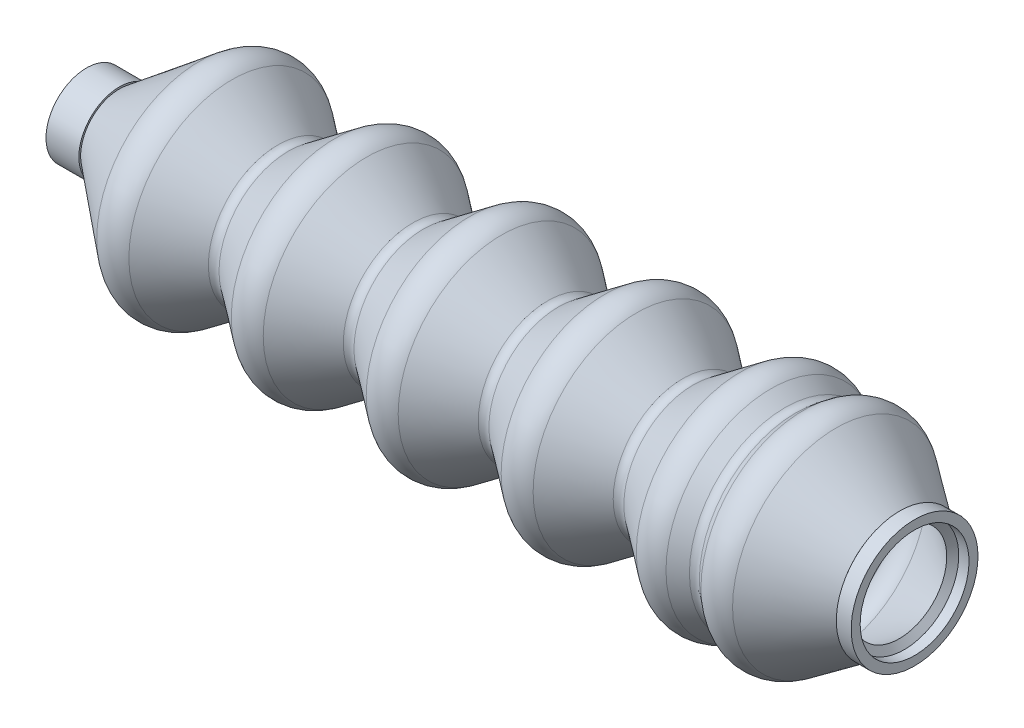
ISO-10303-21;
HEADER;
FILE_DESCRIPTION(('STEP AP214'),'2;1');
FILE_NAME('part.step','',(''),(''),'','','');
FILE_SCHEMA(('AUTOMOTIVE_DESIGN { 1 0 10303 214 1 1 1 1 }'));
ENDSEC;
DATA;
#1=APPLICATION_CONTEXT('core data for automotive mechanical design processes');
#2=APPLICATION_PROTOCOL_DEFINITION('international standard','automotive_design',2000,#1);
#3=PRODUCT_CONTEXT('',#1,'mechanical');
#4=PRODUCT('Part','Part','',(#3));
#5=PRODUCT_RELATED_PRODUCT_CATEGORY('part','',(#4));
#6=PRODUCT_DEFINITION_FORMATION('','',#4);
#7=PRODUCT_DEFINITION_CONTEXT('part definition',#1,'design');
#8=PRODUCT_DEFINITION('design','',#6,#7);
#9=PRODUCT_DEFINITION_SHAPE('','',#8);
#10=(LENGTH_UNIT() NAMED_UNIT(*) SI_UNIT(.MILLI.,.METRE.));
#11=(NAMED_UNIT(*) PLANE_ANGLE_UNIT() SI_UNIT($,.RADIAN.));
#12=(NAMED_UNIT(*) SI_UNIT($,.STERADIAN.) SOLID_ANGLE_UNIT());
#13=UNCERTAINTY_MEASURE_WITH_UNIT(LENGTH_MEASURE(1.E-05),#10,'distance_accuracy_value','');
#14=(GEOMETRIC_REPRESENTATION_CONTEXT(3) GLOBAL_UNCERTAINTY_ASSIGNED_CONTEXT((#13)) GLOBAL_UNIT_ASSIGNED_CONTEXT((#10,
#11,#12)) REPRESENTATION_CONTEXT('',''));
#15=CARTESIAN_POINT('',(0.,0.,0.));
#16=DIRECTION('',(0.,0.,1.));
#17=DIRECTION('',(1.,0.,0.));
#18=AXIS2_PLACEMENT_3D('',#15,#16,#17);
#19=CARTESIAN_POINT('',(327.155555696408,36.6460458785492,0.));
#20=DIRECTION('',(1.,0.,0.));
#21=DIRECTION('',(0.,0.,-1.));
#22=AXIS2_PLACEMENT_3D('',#19,#20,#21);
#23=PLANE('',#22);
#24=CARTESIAN_POINT('',(327.155555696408,42.6955868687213,0.));
#25=DIRECTION('',(1.,0.,0.));
#26=DIRECTION('',(0.,0.,-1.));
#27=AXIS2_PLACEMENT_3D('',#24,#25,#26);
#28=CIRCLE('',#27,7.04954099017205);
#29=CARTESIAN_POINT('',(327.155555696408,42.6955868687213,-7.04954099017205));
#30=VERTEX_POINT('',#29);
#31=EDGE_CURVE('E34',#30,#30,#28,.F.);
#32=ORIENTED_EDGE('',*,*,#31,.F.);
#33=EDGE_LOOP('',(#32));
#34=FACE_BOUND('',#33,.T.);
#35=CARTESIAN_POINT('',(327.155555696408,42.6955868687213,0.));
#36=DIRECTION('',(-1.,0.,0.));
#37=DIRECTION('',(0.,0.,1.));
#38=AXIS2_PLACEMENT_3D('',#35,#36,#37);
#39=CIRCLE('',#38,6.04954099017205);
#40=CARTESIAN_POINT('',(327.155555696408,42.6955868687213,6.04954099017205));
#41=VERTEX_POINT('',#40);
#42=EDGE_CURVE('E200',#41,#41,#39,.T.);
#43=ORIENTED_EDGE('',*,*,#42,.T.);
#44=EDGE_LOOP('',(#43));
#45=FACE_BOUND('',#44,.T.);
#46=ADVANCED_FACE('F30',(#34,#45),#23,.T.);
#47=CARTESIAN_POINT('',(235.109775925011,42.6955868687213,0.));
#48=DIRECTION('',(-1.,0.,0.));
#49=DIRECTION('',(0.,0.,1.));
#50=AXIS2_PLACEMENT_3D('',#47,#48,#49);
#51=PLANE('',#50);
#52=CARTESIAN_POINT('',(235.109775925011,42.6955868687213,0.));
#53=DIRECTION('',(-1.,0.,0.));
#54=DIRECTION('',(0.,0.,1.));
#55=AXIS2_PLACEMENT_3D('',#52,#53,#54);
#56=CIRCLE('',#55,3.50236583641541);
#57=CARTESIAN_POINT('',(235.109775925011,42.6955868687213,3.50236583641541));
#58=VERTEX_POINT('',#57);
#59=EDGE_CURVE('E119',#58,#58,#56,.T.);
#60=ORIENTED_EDGE('',*,*,#59,.F.);
#61=EDGE_LOOP('',(#60));
#62=FACE_BOUND('',#61,.T.);
#63=CARTESIAN_POINT('',(235.109775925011,42.6955868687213,0.));
#64=DIRECTION('',(-1.,0.,0.));
#65=DIRECTION('',(0.,0.,1.));
#66=AXIS2_PLACEMENT_3D('',#63,#64,#65);
#67=CIRCLE('',#66,4.50236583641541);
#68=CARTESIAN_POINT('',(235.109775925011,42.6955868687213,4.50236583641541));
#69=VERTEX_POINT('',#68);
#70=EDGE_CURVE('E10',#69,#69,#67,.T.);
#71=ORIENTED_EDGE('',*,*,#70,.T.);
#72=EDGE_LOOP('',(#71));
#73=FACE_BOUND('',#72,.T.);
#74=ADVANCED_FACE('F367',(#62,#73),#51,.T.);
#75=CARTESIAN_POINT('',(235.109775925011,42.6955868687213,0.));
#76=DIRECTION('',(-1.,0.,0.));
#77=DIRECTION('',(0.,0.,1.));
#78=AXIS2_PLACEMENT_3D('',#75,#76,#77);
#79=CYLINDRICAL_SURFACE('',#78,4.50236583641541);
#80=CARTESIAN_POINT('',(238.763083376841,42.6955868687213,0.));
#81=DIRECTION('',(1.,0.,0.));
#82=DIRECTION('',(0.,0.,-1.));
#83=AXIS2_PLACEMENT_3D('',#80,#81,#82);
#84=CIRCLE('',#83,4.50236583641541);
#85=CARTESIAN_POINT('',(238.763083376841,42.6955868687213,-4.50236583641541));
#86=VERTEX_POINT('',#85);
#87=EDGE_CURVE('E38',#86,#86,#84,.F.);
#88=ORIENTED_EDGE('',*,*,#87,.T.);
#89=EDGE_LOOP('',(#88));
#90=FACE_BOUND('',#89,.T.);
#91=ORIENTED_EDGE('',*,*,#70,.F.);
#92=EDGE_LOOP('',(#91));
#93=FACE_BOUND('',#92,.T.);
#94=ADVANCED_FACE('F369',(#90,#93),#79,.T.);
#95=CARTESIAN_POINT('',(238.763083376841,39.1932210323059,0.));
#96=DIRECTION('',(1.,0.,0.));
#97=DIRECTION('',(0.,0.,-1.));
#98=AXIS2_PLACEMENT_3D('',#95,#96,#97);
#99=PLANE('',#98);
#100=CARTESIAN_POINT('',(238.763083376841,42.6955868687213,0.));
#101=DIRECTION('',(1.,0.,0.));
#102=DIRECTION('',(0.,0.,-1.));
#103=AXIS2_PLACEMENT_3D('',#100,#101,#102);
#104=CIRCLE('',#103,4.30684761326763);
#105=CARTESIAN_POINT('',(238.763083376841,42.6955868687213,-4.30684761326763));
#106=VERTEX_POINT('',#105);
#107=EDGE_CURVE('E42',#106,#106,#104,.F.);
#108=ORIENTED_EDGE('',*,*,#107,.T.);
#109=EDGE_LOOP('',(#108));
#110=FACE_BOUND('',#109,.T.);
#111=ORIENTED_EDGE('',*,*,#87,.F.);
#112=EDGE_LOOP('',(#111));
#113=FACE_BOUND('',#112,.T.);
#114=ADVANCED_FACE('F375',(#110,#113),#99,.T.);
#115=CARTESIAN_POINT('',(237.139138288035,42.6955868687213,0.));
#116=DIRECTION('',(1.,0.,0.));
#117=DIRECTION('',(0.,0.,-1.));
#118=AXIS2_PLACEMENT_3D('',#115,#116,#117);
#119=CONICAL_SURFACE('',#118,3.01024644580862,0.673780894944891);
#120=CARTESIAN_POINT('',(247.639422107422,42.6955868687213,0.));
#121=DIRECTION('',(1.,0.,0.));
#122=DIRECTION('',(0.,0.,-1.));
#123=AXIS2_PLACEMENT_3D('',#120,#121,#122);
#124=CIRCLE('',#123,11.3939537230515);
#125=CARTESIAN_POINT('',(247.639422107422,42.6955868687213,-11.3939537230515));
#126=VERTEX_POINT('',#125);
#127=EDGE_CURVE('E114',#126,#126,#124,.F.);
#128=ORIENTED_EDGE('',*,*,#127,.T.);
#129=EDGE_LOOP('',(#128));
#130=FACE_BOUND('',#129,.T.);
#131=ORIENTED_EDGE('',*,*,#107,.F.);
#132=EDGE_LOOP('',(#131));
#133=FACE_BOUND('',#132,.T.);
#134=ADVANCED_FACE('F383',(#130,#133),#119,.T.);
#135=CARTESIAN_POINT('',(249.511257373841,42.6955868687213,0.));
#136=DIRECTION('',(-1.,0.,0.));
#137=DIRECTION('',(0.,0.,1.));
#138=AXIS2_PLACEMENT_3D('',#135,#136,#137);
#139=TOROIDAL_SURFACE('',#138,9.04954916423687,3.00000000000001);
#140=CARTESIAN_POINT('',(251.287397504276,42.6955868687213,0.));
#141=DIRECTION('',(-1.,0.,0.));
#142=DIRECTION('',(0.,0.,1.));
#143=AXIS2_PLACEMENT_3D('',#140,#141,#142);
#144=CIRCLE('',#143,11.4672601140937);
#145=CARTESIAN_POINT('',(251.287397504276,42.6955868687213,11.4672601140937));
#146=VERTEX_POINT('',#145);
#147=EDGE_CURVE('E111',#146,#146,#144,.T.);
#148=ORIENTED_EDGE('',*,*,#147,.T.);
#149=EDGE_LOOP('',(#148));
#150=FACE_BOUND('',#149,.T.);
#151=ORIENTED_EDGE('',*,*,#127,.F.);
#152=EDGE_LOOP('',(#151));
#153=FACE_BOUND('',#152,.T.);
#154=ADVANCED_FACE('F387',(#150,#153),#139,.T.);
#155=CARTESIAN_POINT('',(251.287397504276,42.6955868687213,0.));
#156=DIRECTION('',(-1.,0.,0.));
#157=DIRECTION('',(0.,0.,1.));
#158=AXIS2_PLACEMENT_3D('',#155,#156,#157);
#159=CONICAL_SURFACE('',#158,11.4672601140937,0.633596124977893);
#160=CARTESIAN_POINT('',(256.380982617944,42.6955868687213,0.));
#161=DIRECTION('',(-1.,0.,0.));
#162=DIRECTION('',(0.,0.,1.));
#163=AXIS2_PLACEMENT_3D('',#160,#161,#162);
#164=CIRCLE('',#163,7.72532358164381);
#165=CARTESIAN_POINT('',(256.380982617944,42.6955868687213,7.72532358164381));
#166=VERTEX_POINT('',#165);
#167=EDGE_CURVE('E108',#166,#166,#164,.T.);
#168=ORIENTED_EDGE('',*,*,#167,.T.);
#169=EDGE_LOOP('',(#168));
#170=FACE_BOUND('',#169,.T.);
#171=ORIENTED_EDGE('',*,*,#147,.F.);
#172=EDGE_LOOP('',(#171));
#173=FACE_BOUND('',#172,.T.);
#174=ADVANCED_FACE('F391',(#170,#173),#159,.T.);
#175=CARTESIAN_POINT('',(256.973029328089,42.6955868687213,0.));
#176=DIRECTION('',(-1.,0.,0.));
#177=DIRECTION('',(0.,0.,1.));
#178=AXIS2_PLACEMENT_3D('',#175,#176,#177);
#179=TOROIDAL_SURFACE('',#178,8.53122723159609,1.00000000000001);
#180=CARTESIAN_POINT('',(257.565076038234,42.6955868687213,0.));
#181=DIRECTION('',(-1.,0.,0.));
#182=DIRECTION('',(0.,0.,1.));
#183=AXIS2_PLACEMENT_3D('',#180,#181,#182);
#184=CIRCLE('',#183,7.7253235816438);
#185=CARTESIAN_POINT('',(257.565076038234,42.6955868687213,7.7253235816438));
#186=VERTEX_POINT('',#185);
#187=EDGE_CURVE('E105',#186,#186,#184,.T.);
#188=ORIENTED_EDGE('',*,*,#187,.T.);
#189=EDGE_LOOP('',(#188));
#190=FACE_BOUND('',#189,.T.);
#191=ORIENTED_EDGE('',*,*,#167,.F.);
#192=EDGE_LOOP('',(#191));
#193=FACE_BOUND('',#192,.T.);
#194=ADVANCED_FACE('F395',(#190,#193),#179,.F.);
#195=CARTESIAN_POINT('',(257.565076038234,42.6955868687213,0.));
#196=DIRECTION('',(1.,0.,0.));
#197=DIRECTION('',(0.,0.,-1.));
#198=AXIS2_PLACEMENT_3D('',#195,#196,#197);
#199=CONICAL_SURFACE('',#198,7.72532358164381,0.633596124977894);
#200=CARTESIAN_POINT('',(262.696889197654,42.6955868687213,0.));
#201=DIRECTION('',(1.,0.,0.));
#202=DIRECTION('',(0.,0.,-1.));
#203=AXIS2_PLACEMENT_3D('',#200,#201,#202);
#204=CIRCLE('',#203,11.4953438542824);
#205=CARTESIAN_POINT('',(262.696889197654,42.6955868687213,-11.4953438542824));
#206=VERTEX_POINT('',#205);
#207=EDGE_CURVE('E102',#206,#206,#204,.F.);
#208=ORIENTED_EDGE('',*,*,#207,.T.);
#209=EDGE_LOOP('',(#208));
#210=FACE_BOUND('',#209,.T.);
#211=ORIENTED_EDGE('',*,*,#187,.F.);
#212=EDGE_LOOP('',(#211));
#213=FACE_BOUND('',#212,.T.);
#214=ADVANCED_FACE('F399',(#210,#213),#199,.T.);
#215=CARTESIAN_POINT('',(264.473029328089,42.6955868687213,0.));
#216=DIRECTION('',(-1.,0.,0.));
#217=DIRECTION('',(0.,0.,1.));
#218=AXIS2_PLACEMENT_3D('',#215,#216,#217);
#219=TOROIDAL_SURFACE('',#218,9.07763290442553,3.00000000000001);
#220=CARTESIAN_POINT('',(266.249169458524,42.6955868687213,0.));
#221=DIRECTION('',(-1.,0.,0.));
#222=DIRECTION('',(0.,0.,1.));
#223=AXIS2_PLACEMENT_3D('',#220,#221,#222);
#224=CIRCLE('',#223,11.4953438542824);
#225=CARTESIAN_POINT('',(266.249169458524,42.6955868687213,11.4953438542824));
#226=VERTEX_POINT('',#225);
#227=EDGE_CURVE('E99',#226,#226,#224,.T.);
#228=ORIENTED_EDGE('',*,*,#227,.T.);
#229=EDGE_LOOP('',(#228));
#230=FACE_BOUND('',#229,.T.);
#231=ORIENTED_EDGE('',*,*,#207,.F.);
#232=EDGE_LOOP('',(#231));
#233=FACE_BOUND('',#232,.T.);
#234=ADVANCED_FACE('F403',(#230,#233),#219,.T.);
#235=CARTESIAN_POINT('',(266.249169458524,42.6955868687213,0.));
#236=DIRECTION('',(-1.,0.,0.));
#237=DIRECTION('',(0.,0.,1.));
#238=AXIS2_PLACEMENT_3D('',#235,#236,#237);
#239=CONICAL_SURFACE('',#238,11.4953438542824,0.633596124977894);
#240=CARTESIAN_POINT('',(271.380982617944,42.6955868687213,0.));
#241=DIRECTION('',(-1.,0.,0.));
#242=DIRECTION('',(0.,0.,1.));
#243=AXIS2_PLACEMENT_3D('',#240,#241,#242);
#244=CIRCLE('',#243,7.72532358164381);
#245=CARTESIAN_POINT('',(271.380982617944,42.6955868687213,7.72532358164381));
#246=VERTEX_POINT('',#245);
#247=EDGE_CURVE('E96',#246,#246,#244,.T.);
#248=ORIENTED_EDGE('',*,*,#247,.T.);
#249=EDGE_LOOP('',(#248));
#250=FACE_BOUND('',#249,.T.);
#251=ORIENTED_EDGE('',*,*,#227,.F.);
#252=EDGE_LOOP('',(#251));
#253=FACE_BOUND('',#252,.T.);
#254=ADVANCED_FACE('F407',(#250,#253),#239,.T.);
#255=CARTESIAN_POINT('',(271.973029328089,42.6955868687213,0.));
#256=DIRECTION('',(-1.,0.,0.));
#257=DIRECTION('',(0.,0.,1.));
#258=AXIS2_PLACEMENT_3D('',#255,#256,#257);
#259=TOROIDAL_SURFACE('',#258,8.53122723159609,1.00000000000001);
#260=CARTESIAN_POINT('',(272.565076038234,42.6955868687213,0.));
#261=DIRECTION('',(-1.,0.,0.));
#262=DIRECTION('',(0.,0.,1.));
#263=AXIS2_PLACEMENT_3D('',#260,#261,#262);
#264=CIRCLE('',#263,7.72532358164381);
#265=CARTESIAN_POINT('',(272.565076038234,42.6955868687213,7.72532358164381));
#266=VERTEX_POINT('',#265);
#267=EDGE_CURVE('E93',#266,#266,#264,.T.);
#268=ORIENTED_EDGE('',*,*,#267,.T.);
#269=EDGE_LOOP('',(#268));
#270=FACE_BOUND('',#269,.T.);
#271=ORIENTED_EDGE('',*,*,#247,.F.);
#272=EDGE_LOOP('',(#271));
#273=FACE_BOUND('',#272,.T.);
#274=ADVANCED_FACE('F411',(#270,#273),#259,.F.);
#275=CARTESIAN_POINT('',(272.565076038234,42.6955868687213,0.));
#276=DIRECTION('',(1.,0.,0.));
#277=DIRECTION('',(0.,0.,-1.));
#278=AXIS2_PLACEMENT_3D('',#275,#276,#277);
#279=CONICAL_SURFACE('',#278,7.72532358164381,0.633596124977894);
#280=CARTESIAN_POINT('',(277.696889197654,42.6955868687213,0.));
#281=DIRECTION('',(1.,0.,0.));
#282=DIRECTION('',(0.,0.,-1.));
#283=AXIS2_PLACEMENT_3D('',#280,#281,#282);
#284=CIRCLE('',#283,11.4953438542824);
#285=CARTESIAN_POINT('',(277.696889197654,42.6955868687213,-11.4953438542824));
#286=VERTEX_POINT('',#285);
#287=EDGE_CURVE('E90',#286,#286,#284,.F.);
#288=ORIENTED_EDGE('',*,*,#287,.T.);
#289=EDGE_LOOP('',(#288));
#290=FACE_BOUND('',#289,.T.);
#291=ORIENTED_EDGE('',*,*,#267,.F.);
#292=EDGE_LOOP('',(#291));
#293=FACE_BOUND('',#292,.T.);
#294=ADVANCED_FACE('F415',(#290,#293),#279,.T.);
#295=CARTESIAN_POINT('',(279.473029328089,42.6955868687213,0.));
#296=DIRECTION('',(-1.,0.,0.));
#297=DIRECTION('',(0.,0.,1.));
#298=AXIS2_PLACEMENT_3D('',#295,#296,#297);
#299=TOROIDAL_SURFACE('',#298,9.07763290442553,3.00000000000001);
#300=CARTESIAN_POINT('',(281.249169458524,42.6955868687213,0.));
#301=DIRECTION('',(-1.,0.,0.));
#302=DIRECTION('',(0.,0.,1.));
#303=AXIS2_PLACEMENT_3D('',#300,#301,#302);
#304=CIRCLE('',#303,11.4953438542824);
#305=CARTESIAN_POINT('',(281.249169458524,42.6955868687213,11.4953438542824));
#306=VERTEX_POINT('',#305);
#307=EDGE_CURVE('E87',#306,#306,#304,.T.);
#308=ORIENTED_EDGE('',*,*,#307,.T.);
#309=EDGE_LOOP('',(#308));
#310=FACE_BOUND('',#309,.T.);
#311=ORIENTED_EDGE('',*,*,#287,.F.);
#312=EDGE_LOOP('',(#311));
#313=FACE_BOUND('',#312,.T.);
#314=ADVANCED_FACE('F419',(#310,#313),#299,.T.);
#315=CARTESIAN_POINT('',(281.249169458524,42.6955868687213,0.));
#316=DIRECTION('',(-1.,0.,0.));
#317=DIRECTION('',(0.,0.,1.));
#318=AXIS2_PLACEMENT_3D('',#315,#316,#317);
#319=CONICAL_SURFACE('',#318,11.4953438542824,0.633596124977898);
#320=CARTESIAN_POINT('',(286.380982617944,42.6955868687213,0.));
#321=DIRECTION('',(-1.,0.,0.));
#322=DIRECTION('',(0.,0.,1.));
#323=AXIS2_PLACEMENT_3D('',#320,#321,#322);
#324=CIRCLE('',#323,7.72532358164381);
#325=CARTESIAN_POINT('',(286.380982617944,42.6955868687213,7.72532358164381));
#326=VERTEX_POINT('',#325);
#327=EDGE_CURVE('E84',#326,#326,#324,.T.);
#328=ORIENTED_EDGE('',*,*,#327,.T.);
#329=EDGE_LOOP('',(#328));
#330=FACE_BOUND('',#329,.T.);
#331=ORIENTED_EDGE('',*,*,#307,.F.);
#332=EDGE_LOOP('',(#331));
#333=FACE_BOUND('',#332,.T.);
#334=ADVANCED_FACE('F423',(#330,#333),#319,.T.);
#335=CARTESIAN_POINT('',(286.973029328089,42.6955868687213,0.));
#336=DIRECTION('',(-1.,0.,0.));
#337=DIRECTION('',(0.,0.,1.));
#338=AXIS2_PLACEMENT_3D('',#335,#336,#337);
#339=TOROIDAL_SURFACE('',#338,8.53122723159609,1.00000000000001);
#340=CARTESIAN_POINT('',(287.565076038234,42.6955868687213,0.));
#341=DIRECTION('',(-1.,0.,0.));
#342=DIRECTION('',(0.,0.,1.));
#343=AXIS2_PLACEMENT_3D('',#340,#341,#342);
#344=CIRCLE('',#343,7.7253235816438);
#345=CARTESIAN_POINT('',(287.565076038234,42.6955868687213,7.7253235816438));
#346=VERTEX_POINT('',#345);
#347=EDGE_CURVE('E81',#346,#346,#344,.T.);
#348=ORIENTED_EDGE('',*,*,#347,.T.);
#349=EDGE_LOOP('',(#348));
#350=FACE_BOUND('',#349,.T.);
#351=ORIENTED_EDGE('',*,*,#327,.F.);
#352=EDGE_LOOP('',(#351));
#353=FACE_BOUND('',#352,.T.);
#354=ADVANCED_FACE('F427',(#350,#353),#339,.F.);
#355=CARTESIAN_POINT('',(287.565076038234,42.6955868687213,0.));
#356=DIRECTION('',(1.,0.,0.));
#357=DIRECTION('',(0.,0.,-1.));
#358=AXIS2_PLACEMENT_3D('',#355,#356,#357);
#359=CONICAL_SURFACE('',#358,7.72532358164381,0.633596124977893);
#360=CARTESIAN_POINT('',(292.696889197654,42.6955868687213,0.));
#361=DIRECTION('',(1.,0.,0.));
#362=DIRECTION('',(0.,0.,-1.));
#363=AXIS2_PLACEMENT_3D('',#360,#361,#362);
#364=CIRCLE('',#363,11.4953438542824);
#365=CARTESIAN_POINT('',(292.696889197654,42.6955868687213,-11.4953438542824));
#366=VERTEX_POINT('',#365);
#367=EDGE_CURVE('E78',#366,#366,#364,.F.);
#368=ORIENTED_EDGE('',*,*,#367,.T.);
#369=EDGE_LOOP('',(#368));
#370=FACE_BOUND('',#369,.T.);
#371=ORIENTED_EDGE('',*,*,#347,.F.);
#372=EDGE_LOOP('',(#371));
#373=FACE_BOUND('',#372,.T.);
#374=ADVANCED_FACE('F431',(#370,#373),#359,.T.);
#375=CARTESIAN_POINT('',(294.473029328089,42.6955868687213,0.));
#376=DIRECTION('',(-1.,0.,0.));
#377=DIRECTION('',(0.,0.,1.));
#378=AXIS2_PLACEMENT_3D('',#375,#376,#377);
#379=TOROIDAL_SURFACE('',#378,9.07763290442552,3.00000000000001);
#380=CARTESIAN_POINT('',(296.249169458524,42.6955868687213,0.));
#381=DIRECTION('',(-1.,0.,0.));
#382=DIRECTION('',(0.,0.,1.));
#383=AXIS2_PLACEMENT_3D('',#380,#381,#382);
#384=CIRCLE('',#383,11.4953438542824);
#385=CARTESIAN_POINT('',(296.249169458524,42.6955868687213,11.4953438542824));
#386=VERTEX_POINT('',#385);
#387=EDGE_CURVE('E75',#386,#386,#384,.T.);
#388=ORIENTED_EDGE('',*,*,#387,.T.);
#389=EDGE_LOOP('',(#388));
#390=FACE_BOUND('',#389,.T.);
#391=ORIENTED_EDGE('',*,*,#367,.F.);
#392=EDGE_LOOP('',(#391));
#393=FACE_BOUND('',#392,.T.);
#394=ADVANCED_FACE('F435',(#390,#393),#379,.T.);
#395=CARTESIAN_POINT('',(296.249169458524,42.6955868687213,0.));
#396=DIRECTION('',(-1.,0.,0.));
#397=DIRECTION('',(0.,0.,1.));
#398=AXIS2_PLACEMENT_3D('',#395,#396,#397);
#399=CONICAL_SURFACE('',#398,11.4953438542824,0.633596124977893);
#400=CARTESIAN_POINT('',(301.380982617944,42.6955868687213,0.));
#401=DIRECTION('',(-1.,0.,0.));
#402=DIRECTION('',(0.,0.,1.));
#403=AXIS2_PLACEMENT_3D('',#400,#401,#402);
#404=CIRCLE('',#403,7.72532358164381);
#405=CARTESIAN_POINT('',(301.380982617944,42.6955868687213,7.72532358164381));
#406=VERTEX_POINT('',#405);
#407=EDGE_CURVE('E72',#406,#406,#404,.T.);
#408=ORIENTED_EDGE('',*,*,#407,.T.);
#409=EDGE_LOOP('',(#408));
#410=FACE_BOUND('',#409,.T.);
#411=ORIENTED_EDGE('',*,*,#387,.F.);
#412=EDGE_LOOP('',(#411));
#413=FACE_BOUND('',#412,.T.);
#414=ADVANCED_FACE('F439',(#410,#413),#399,.T.);
#415=CARTESIAN_POINT('',(301.973029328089,42.6955868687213,0.));
#416=DIRECTION('',(-1.,0.,0.));
#417=DIRECTION('',(0.,0.,1.));
#418=AXIS2_PLACEMENT_3D('',#415,#416,#417);
#419=TOROIDAL_SURFACE('',#418,8.53122723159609,1.00000000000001);
#420=CARTESIAN_POINT('',(302.565076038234,42.6955868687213,0.));
#421=DIRECTION('',(-1.,0.,0.));
#422=DIRECTION('',(0.,0.,1.));
#423=AXIS2_PLACEMENT_3D('',#420,#421,#422);
#424=CIRCLE('',#423,7.7253235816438);
#425=CARTESIAN_POINT('',(302.565076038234,42.6955868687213,7.7253235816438));
#426=VERTEX_POINT('',#425);
#427=EDGE_CURVE('E69',#426,#426,#424,.T.);
#428=ORIENTED_EDGE('',*,*,#427,.T.);
#429=EDGE_LOOP('',(#428));
#430=FACE_BOUND('',#429,.T.);
#431=ORIENTED_EDGE('',*,*,#407,.F.);
#432=EDGE_LOOP('',(#431));
#433=FACE_BOUND('',#432,.T.);
#434=ADVANCED_FACE('F443',(#430,#433),#419,.F.);
#435=CARTESIAN_POINT('',(302.565076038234,42.6955868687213,0.));
#436=DIRECTION('',(1.,0.,0.));
#437=DIRECTION('',(0.,0.,-1.));
#438=AXIS2_PLACEMENT_3D('',#435,#436,#437);
#439=CONICAL_SURFACE('',#438,7.72532358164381,0.633596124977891);
#440=CARTESIAN_POINT('',(307.783150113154,42.6955868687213,0.));
#441=DIRECTION('',(1.,0.,0.));
#442=DIRECTION('',(0.,0.,-1.));
#443=AXIS2_PLACEMENT_3D('',#440,#441,#442);
#444=CIRCLE('',#443,11.5587143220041);
#445=CARTESIAN_POINT('',(307.783150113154,42.6955868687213,-11.5587143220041));
#446=VERTEX_POINT('',#445);
#447=EDGE_CURVE('E66',#446,#446,#444,.F.);
#448=ORIENTED_EDGE('',*,*,#447,.T.);
#449=EDGE_LOOP('',(#448));
#450=FACE_BOUND('',#449,.T.);
#451=ORIENTED_EDGE('',*,*,#427,.F.);
#452=EDGE_LOOP('',(#451));
#453=FACE_BOUND('',#452,.T.);
#454=ADVANCED_FACE('F447',(#450,#453),#439,.T.);
#455=CARTESIAN_POINT('',(309.55929024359,42.6955868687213,0.));
#456=DIRECTION('',(-1.,0.,0.));
#457=DIRECTION('',(0.,0.,1.));
#458=AXIS2_PLACEMENT_3D('',#455,#456,#457);
#459=TOROIDAL_SURFACE('',#458,9.14100337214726,2.99999999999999);
#460=CARTESIAN_POINT('',(311.185126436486,42.6955868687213,0.));
#461=DIRECTION('',(-1.,0.,0.));
#462=DIRECTION('',(0.,0.,1.));
#463=AXIS2_PLACEMENT_3D('',#460,#461,#462);
#464=CIRCLE('',#463,11.662244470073);
#465=CARTESIAN_POINT('',(311.185126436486,42.6955868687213,11.662244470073));
#466=VERTEX_POINT('',#465);
#467=EDGE_CURVE('E63',#466,#466,#464,.T.);
#468=ORIENTED_EDGE('',*,*,#467,.T.);
#469=EDGE_LOOP('',(#468));
#470=FACE_BOUND('',#469,.T.);
#471=ORIENTED_EDGE('',*,*,#447,.F.);
#472=EDGE_LOOP('',(#471));
#473=FACE_BOUND('',#472,.T.);
#474=ADVANCED_FACE('F451',(#470,#473),#459,.T.);
#475=CARTESIAN_POINT('',(311.185126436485,42.6955868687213,0.));
#476=DIRECTION('',(-1.,0.,0.));
#477=DIRECTION('',(0.,0.,1.));
#478=AXIS2_PLACEMENT_3D('',#475,#476,#477);
#479=CONICAL_SURFACE('',#478,11.662244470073,0.572750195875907);
#480=CARTESIAN_POINT('',(312.767869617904,42.6955868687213,0.));
#481=DIRECTION('',(-1.,0.,0.));
#482=DIRECTION('',(0.,0.,1.));
#483=AXIS2_PLACEMENT_3D('',#480,#481,#482);
#484=CIRCLE('',#483,10.6416038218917);
#485=CARTESIAN_POINT('',(312.767869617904,42.6955868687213,10.6416038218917));
#486=VERTEX_POINT('',#485);
#487=EDGE_CURVE('E60',#486,#486,#484,.T.);
#488=ORIENTED_EDGE('',*,*,#487,.T.);
#489=EDGE_LOOP('',(#488));
#490=FACE_BOUND('',#489,.T.);
#491=ORIENTED_EDGE('',*,*,#467,.F.);
#492=EDGE_LOOP('',(#491));
#493=FACE_BOUND('',#492,.T.);
#494=ADVANCED_FACE('F455',(#490,#493),#479,.T.);
#495=CARTESIAN_POINT('',(313.309815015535,42.6955868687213,0.));
#496=DIRECTION('',(-1.,0.,0.));
#497=DIRECTION('',(0.,0.,1.));
#498=AXIS2_PLACEMENT_3D('',#495,#496,#497);
#499=TOROIDAL_SURFACE('',#498,11.4820175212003,0.999999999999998);
#500=CARTESIAN_POINT('',(313.93451006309,42.6955868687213,0.));
#501=DIRECTION('',(-1.,0.,0.));
#502=DIRECTION('',(0.,0.,1.));
#503=AXIS2_PLACEMENT_3D('',#500,#501,#502);
#504=CIRCLE('',#503,10.7011487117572);
#505=CARTESIAN_POINT('',(313.93451006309,42.6955868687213,10.7011487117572));
#506=VERTEX_POINT('',#505);
#507=EDGE_CURVE('E57',#506,#506,#504,.T.);
#508=ORIENTED_EDGE('',*,*,#507,.T.);
#509=EDGE_LOOP('',(#508));
#510=FACE_BOUND('',#509,.T.);
#511=ORIENTED_EDGE('',*,*,#487,.F.);
#512=EDGE_LOOP('',(#511));
#513=FACE_BOUND('',#512,.T.);
#514=ADVANCED_FACE('F459',(#510,#513),#499,.F.);
#515=CARTESIAN_POINT('',(313.93451006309,42.6955868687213,0.));
#516=DIRECTION('',(1.,0.,0.));
#517=DIRECTION('',(0.,0.,-1.));
#518=AXIS2_PLACEMENT_3D('',#515,#516,#517);
#519=CONICAL_SURFACE('',#518,10.7011487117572,0.674740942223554);
#520=CARTESIAN_POINT('',(314.815198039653,42.6955868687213,0.));
#521=DIRECTION('',(1.,0.,0.));
#522=DIRECTION('',(0.,0.,-1.));
#523=AXIS2_PLACEMENT_3D('',#520,#521,#522);
#524=CIRCLE('',#523,11.4056990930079);
#525=CARTESIAN_POINT('',(314.815198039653,42.6955868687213,-11.4056990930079));
#526=VERTEX_POINT('',#525);
#527=EDGE_CURVE('E54',#526,#526,#524,.F.);
#528=ORIENTED_EDGE('',*,*,#527,.T.);
#529=EDGE_LOOP('',(#528));
#530=FACE_BOUND('',#529,.T.);
#531=ORIENTED_EDGE('',*,*,#507,.F.);
#532=EDGE_LOOP('',(#531));
#533=FACE_BOUND('',#532,.T.);
#534=ADVANCED_FACE('F463',(#530,#533),#519,.T.);
#535=CARTESIAN_POINT('',(316.689283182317,42.6955868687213,0.));
#536=DIRECTION('',(-1.,0.,0.));
#537=DIRECTION('',(0.,0.,1.));
#538=AXIS2_PLACEMENT_3D('',#535,#536,#537);
#539=TOROIDAL_SURFACE('',#538,9.06309266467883,3.);
#540=CARTESIAN_POINT('',(318.429830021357,42.6955868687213,0.));
#541=DIRECTION('',(-1.,0.,0.));
#542=DIRECTION('',(0.,0.,1.));
#543=AXIS2_PLACEMENT_3D('',#540,#541,#542);
#544=CIRCLE('',#543,11.5065526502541);
#545=CARTESIAN_POINT('',(318.429830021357,42.6955868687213,11.5065526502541));
#546=VERTEX_POINT('',#545);
#547=EDGE_CURVE('E51',#546,#546,#544,.T.);
#548=ORIENTED_EDGE('',*,*,#547,.T.);
#549=EDGE_LOOP('',(#548));
#550=FACE_BOUND('',#549,.T.);
#551=ORIENTED_EDGE('',*,*,#527,.F.);
#552=EDGE_LOOP('',(#551));
#553=FACE_BOUND('',#552,.T.);
#554=ADVANCED_FACE('F467',(#550,#553),#539,.T.);
#555=CARTESIAN_POINT('',(318.429830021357,42.6955868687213,0.));
#556=DIRECTION('',(-1.,0.,0.));
#557=DIRECTION('',(0.,0.,1.));
#558=AXIS2_PLACEMENT_3D('',#555,#556,#557);
#559=CONICAL_SURFACE('',#558,11.5065526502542,0.618952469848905);
#560=CARTESIAN_POINT('',(325.227417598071,42.6955868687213,0.));
#561=DIRECTION('',(-1.,0.,0.));
#562=DIRECTION('',(0.,0.,1.));
#563=AXIS2_PLACEMENT_3D('',#560,#561,#562);
#564=CIRCLE('',#563,6.66443547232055);
#565=CARTESIAN_POINT('',(325.227417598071,42.6955868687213,6.66443547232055));
#566=VERTEX_POINT('',#565);
#567=EDGE_CURVE('E48',#566,#566,#564,.T.);
#568=ORIENTED_EDGE('',*,*,#567,.T.);
#569=EDGE_LOOP('',(#568));
#570=FACE_BOUND('',#569,.T.);
#571=ORIENTED_EDGE('',*,*,#547,.F.);
#572=EDGE_LOOP('',(#571));
#573=FACE_BOUND('',#572,.T.);
#574=ADVANCED_FACE('F471',(#570,#573),#559,.T.);
#575=CARTESIAN_POINT('',(324.647235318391,42.6955868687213,0.));
#576=DIRECTION('',(1.,0.,0.));
#577=DIRECTION('',(0.,0.,-1.));
#578=AXIS2_PLACEMENT_3D('',#575,#576,#577);
#579=CONICAL_SURFACE('',#578,5.84994881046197,0.951843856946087);
#580=CARTESIAN_POINT('',(325.501739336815,42.6955868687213,0.));
#581=DIRECTION('',(1.,0.,0.));
#582=DIRECTION('',(0.,0.,-1.));
#583=AXIS2_PLACEMENT_3D('',#580,#581,#582);
#584=CIRCLE('',#583,7.04954099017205);
#585=CARTESIAN_POINT('',(325.501739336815,42.6955868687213,-7.04954099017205));
#586=VERTEX_POINT('',#585);
#587=EDGE_CURVE('E45',#586,#586,#584,.F.);
#588=ORIENTED_EDGE('',*,*,#587,.T.);
#589=EDGE_LOOP('',(#588));
#590=FACE_BOUND('',#589,.T.);
#591=ORIENTED_EDGE('',*,*,#567,.F.);
#592=EDGE_LOOP('',(#591));
#593=FACE_BOUND('',#592,.T.);
#594=ADVANCED_FACE('F474',(#590,#593),#579,.T.);
#595=CARTESIAN_POINT('',(235.109775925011,42.6955868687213,0.));
#596=DIRECTION('',(-1.,0.,0.));
#597=DIRECTION('',(0.,0.,1.));
#598=AXIS2_PLACEMENT_3D('',#595,#596,#597);
#599=CYLINDRICAL_SURFACE('',#598,7.04954099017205);
#600=ORIENTED_EDGE('',*,*,#31,.T.);
#601=EDGE_LOOP('',(#600));
#602=FACE_BOUND('',#601,.T.);
#603=ORIENTED_EDGE('',*,*,#587,.F.);
#604=EDGE_LOOP('',(#603));
#605=FACE_BOUND('',#604,.T.);
#606=ADVANCED_FACE('F32',(#602,#605),#599,.T.);
#607=CARTESIAN_POINT('',(235.109775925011,42.6955868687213,0.));
#608=DIRECTION('',(-1.,0.,0.));
#609=DIRECTION('',(0.,0.,1.));
#610=AXIS2_PLACEMENT_3D('',#607,#608,#609);
#611=CYLINDRICAL_SURFACE('',#610,3.50236583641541);
#612=CARTESIAN_POINT('',(237.763083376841,42.6955868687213,0.));
#613=DIRECTION('',(-1.,0.,0.));
#614=DIRECTION('',(0.,0.,1.));
#615=AXIS2_PLACEMENT_3D('',#612,#613,#614);
#616=CIRCLE('',#615,3.50236583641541);
#617=CARTESIAN_POINT('',(237.763083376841,42.6955868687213,3.50236583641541));
#618=VERTEX_POINT('',#617);
#619=EDGE_CURVE('E122',#618,#618,#616,.T.);
#620=ORIENTED_EDGE('',*,*,#619,.F.);
#621=EDGE_LOOP('',(#620));
#622=FACE_BOUND('',#621,.T.);
#623=ORIENTED_EDGE('',*,*,#59,.T.);
#624=EDGE_LOOP('',(#623));
#625=FACE_BOUND('',#624,.T.);
#626=ADVANCED_FACE('F358',(#622,#625),#611,.F.);
#627=CARTESIAN_POINT('',(237.763083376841,39.1932210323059,0.));
#628=DIRECTION('',(1.,0.,0.));
#629=DIRECTION('',(0.,0.,-1.));
#630=AXIS2_PLACEMENT_3D('',#627,#628,#629);
#631=PLANE('',#630);
#632=CARTESIAN_POINT('',(237.763083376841,42.6955868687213,0.));
#633=DIRECTION('',(-1.,0.,0.));
#634=DIRECTION('',(0.,0.,1.));
#635=AXIS2_PLACEMENT_3D('',#632,#633,#634);
#636=CIRCLE('',#635,2.22877825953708);
#637=CARTESIAN_POINT('',(237.763083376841,42.6955868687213,-2.22877825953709));
#638=VERTEX_POINT('',#637);
#639=EDGE_CURVE('E125',#638,#638,#636,.T.);
#640=ORIENTED_EDGE('',*,*,#639,.F.);
#641=EDGE_LOOP('',(#640));
#642=FACE_BOUND('',#641,.T.);
#643=ORIENTED_EDGE('',*,*,#619,.T.);
#644=EDGE_LOOP('',(#643));
#645=FACE_BOUND('',#644,.T.);
#646=ADVANCED_FACE('F352',(#642,#645),#631,.F.);
#647=CARTESIAN_POINT('',(237.763083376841,42.6955868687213,0.));
#648=DIRECTION('',(1.,0.,0.));
#649=DIRECTION('',(0.,0.,-1.));
#650=AXIS2_PLACEMENT_3D('',#647,#648,#649);
#651=CONICAL_SURFACE('',#650,2.22877825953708,0.673780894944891);
#652=CARTESIAN_POINT('',(248.263367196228,42.6955868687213,0.));
#653=DIRECTION('',(-1.,0.,0.));
#654=DIRECTION('',(0.,0.,1.));
#655=AXIS2_PLACEMENT_3D('',#652,#653,#654);
#656=CIRCLE('',#655,10.6124855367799);
#657=CARTESIAN_POINT('',(248.263367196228,42.6955868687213,-10.61248553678));
#658=VERTEX_POINT('',#657);
#659=EDGE_CURVE('E128',#658,#658,#656,.T.);
#660=CARTESIAN_POINT('',(248.263367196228,42.6955868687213,-10.61248553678));
#661=CARTESIAN_POINT('',(248.153989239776,42.6955868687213,-10.525155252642));
#662=CARTESIAN_POINT('',(248.044611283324,42.6955868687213,-10.4378249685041));
#663=CARTESIAN_POINT('',(247.82585537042,42.6955868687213,-10.2631644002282));
#664=CARTESIAN_POINT('',(247.716477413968,42.6955868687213,-10.1758341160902));
#665=CARTESIAN_POINT('',(247.497721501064,42.6955868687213,-10.0011735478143));
#666=CARTESIAN_POINT('',(247.388343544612,42.6955868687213,-9.91384326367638));
#667=CARTESIAN_POINT('',(247.169587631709,42.6955868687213,-9.73918269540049));
#668=CARTESIAN_POINT('',(247.060209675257,42.6955868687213,-9.65185241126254));
#669=CARTESIAN_POINT('',(246.841453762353,42.6955868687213,-9.47719184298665));
#670=CARTESIAN_POINT('',(246.732075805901,42.6955868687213,-9.38986155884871));
#671=CARTESIAN_POINT('',(246.513319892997,42.6955868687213,-9.21520099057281));
#672=CARTESIAN_POINT('',(246.403941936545,42.6955868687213,-9.12787070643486));
#673=CARTESIAN_POINT('',(246.185186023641,42.6955868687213,-8.95321013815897));
#674=CARTESIAN_POINT('',(246.075808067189,42.6955868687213,-8.86587985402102));
#675=CARTESIAN_POINT('',(245.857052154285,42.6955868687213,-8.69121928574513));
#676=CARTESIAN_POINT('',(245.747674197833,42.6955868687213,-8.60388900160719));
#677=CARTESIAN_POINT('',(245.528918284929,42.6955868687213,-8.42922843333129));
#678=CARTESIAN_POINT('',(245.419540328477,42.6955868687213,-8.34189814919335));
#679=CARTESIAN_POINT('',(245.200784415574,42.6955868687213,-8.16723758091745));
#680=CARTESIAN_POINT('',(245.091406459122,42.6955868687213,-8.07990729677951));
#681=CARTESIAN_POINT('',(244.872650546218,42.6955868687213,-7.90524672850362));
#682=CARTESIAN_POINT('',(244.763272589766,42.6955868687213,-7.81791644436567));
#683=CARTESIAN_POINT('',(244.544516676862,42.6955868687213,-7.64325587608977));
#684=CARTESIAN_POINT('',(244.43513872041,42.6955868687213,-7.55592559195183));
#685=CARTESIAN_POINT('',(244.216382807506,42.6955868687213,-7.38126502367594));
#686=CARTESIAN_POINT('',(244.107004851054,42.6955868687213,-7.29393473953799));
#687=CARTESIAN_POINT('',(243.88824893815,42.6955868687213,-7.1192741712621));
#688=CARTESIAN_POINT('',(243.778870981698,42.6955868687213,-7.03194388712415));
#689=CARTESIAN_POINT('',(243.560115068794,42.6955868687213,-6.85728331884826));
#690=CARTESIAN_POINT('',(243.450737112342,42.6955868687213,-6.76995303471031));
#691=CARTESIAN_POINT('',(243.231981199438,42.6955868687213,-6.59529246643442));
#692=CARTESIAN_POINT('',(243.122603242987,42.6955868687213,-6.50796218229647));
#693=CARTESIAN_POINT('',(242.903847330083,42.6955868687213,-6.33330161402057));
#694=CARTESIAN_POINT('',(242.794469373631,42.6955868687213,-6.24597132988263));
#695=CARTESIAN_POINT('',(242.575713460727,42.6955868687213,-6.07131076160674));
#696=CARTESIAN_POINT('',(242.466335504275,42.6955868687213,-5.98398047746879));
#697=CARTESIAN_POINT('',(242.247579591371,42.6955868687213,-5.8093199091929));
#698=CARTESIAN_POINT('',(242.138201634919,42.6955868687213,-5.72198962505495));
#699=CARTESIAN_POINT('',(241.919445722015,42.6955868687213,-5.54732905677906));
#700=CARTESIAN_POINT('',(241.810067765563,42.6955868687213,-5.45999877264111));
#701=CARTESIAN_POINT('',(241.591311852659,42.6955868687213,-5.28533820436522));
#702=CARTESIAN_POINT('',(241.481933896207,42.6955868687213,-5.19800792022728));
#703=CARTESIAN_POINT('',(241.263177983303,42.6955868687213,-5.02334735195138));
#704=CARTESIAN_POINT('',(241.153800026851,42.6955868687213,-4.93601706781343));
#705=CARTESIAN_POINT('',(240.935044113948,42.6955868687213,-4.76135649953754));
#706=CARTESIAN_POINT('',(240.825666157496,42.6955868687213,-4.67402621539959));
#707=CARTESIAN_POINT('',(240.606910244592,42.6955868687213,-4.4993656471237));
#708=CARTESIAN_POINT('',(240.49753228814,42.6955868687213,-4.41203536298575));
#709=CARTESIAN_POINT('',(240.278776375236,42.6955868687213,-4.23737479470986));
#710=CARTESIAN_POINT('',(240.169398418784,42.6955868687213,-4.15004451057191));
#711=CARTESIAN_POINT('',(239.95064250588,42.6955868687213,-3.97538394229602));
#712=CARTESIAN_POINT('',(239.841264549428,42.6955868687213,-3.88805365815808));
#713=CARTESIAN_POINT('',(239.622508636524,42.6955868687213,-3.71339308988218));
#714=CARTESIAN_POINT('',(239.513130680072,42.6955868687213,-3.62606280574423));
#715=CARTESIAN_POINT('',(239.294374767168,42.6955868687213,-3.45140223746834));
#716=CARTESIAN_POINT('',(239.184996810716,42.6955868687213,-3.3640719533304));
#717=CARTESIAN_POINT('',(238.966240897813,42.6955868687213,-3.1894113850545));
#718=CARTESIAN_POINT('',(238.856862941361,42.6955868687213,-3.10208110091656));
#719=CARTESIAN_POINT('',(238.638107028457,42.6955868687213,-2.92742053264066));
#720=CARTESIAN_POINT('',(238.528729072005,42.6955868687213,-2.84009024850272));
#721=CARTESIAN_POINT('',(238.309973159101,42.6955868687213,-2.66542968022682));
#722=CARTESIAN_POINT('',(238.200595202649,42.6955868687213,-2.57809939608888));
#723=CARTESIAN_POINT('',(237.981839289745,42.6955868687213,-2.40343882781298));
#724=CARTESIAN_POINT('',(237.872461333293,42.6955868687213,-2.31610854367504));
#725=CARTESIAN_POINT('',(237.763083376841,42.6955868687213,-2.22877825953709));
#726=B_SPLINE_CURVE_WITH_KNOTS('',3,(#660,#661,#662,#663,#664,#665,#666,#667,#668,#669,#670,
#671,#672,#673,#674,#675,#676,#677,#678,#679,#680,#681,#682,#683,#684,#685,#686,#687,#688,#689,
#690,#691,#692,#693,#694,#695,#696,#697,#698,#699,#700,#701,#702,#703,#704,#705,#706,#707,#708,
#709,#710,#711,#712,#713,#714,#715,#716,#717,#718,#719,#720,#721,#722,#723,#724,#725),
.UNSPECIFIED.,.F.,.F.,(4,2,2,2,2,2,2,2,2,2,2,2,2,2,2,2,2,2,2,2,2,2,2,2,2,2,2,2,2,2,2,2,4),(0.,
0.419894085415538,0.839788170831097,1.25968225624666,1.67957634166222,2.09947042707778,
2.51936451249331,2.93925859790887,3.35915268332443,3.77904676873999,4.19894085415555,
4.61883493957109,5.03872902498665,5.45862311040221,5.87851719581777,6.29841128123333,
6.71830536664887,7.13819945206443,7.55809353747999,7.97798762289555,8.39788170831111,
8.81777579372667,9.2376698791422,9.65756396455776,10.0774580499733,10.4973521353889,
10.9172462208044,11.33714030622,11.7570343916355,12.1769284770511,12.5968225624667,
13.0167166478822,13.4366107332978),.UNSPECIFIED.);
#727=EDGE_CURVE('BSEAM346',#658,#638,#726,.T.);
#728=ORIENTED_EDGE('',*,*,#659,.F.);
#729=ORIENTED_EDGE('',*,*,#639,.T.);
#730=ORIENTED_EDGE('',*,*,#727,.T.);
#731=ORIENTED_EDGE('',*,*,#727,.F.);
#732=EDGE_LOOP('',(#728,#730,#729,#731));
#733=FACE_BOUND('',#732,.T.);
#734=ADVANCED_FACE('F346',(#733),#651,.F.);
#735=CARTESIAN_POINT('',(249.511257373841,42.6955868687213,0.));
#736=DIRECTION('',(-1.,0.,0.));
#737=DIRECTION('',(0.,0.,1.));
#738=AXIS2_PLACEMENT_3D('',#735,#736,#737);
#739=TOROIDAL_SURFACE('',#738,9.04954916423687,2.00000000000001);
#740=CARTESIAN_POINT('',(250.695350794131,42.6955868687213,0.));
#741=DIRECTION('',(-1.,0.,0.));
#742=DIRECTION('',(0.,0.,1.));
#743=AXIS2_PLACEMENT_3D('',#740,#741,#742);
#744=CIRCLE('',#743,10.6613564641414);
#745=CARTESIAN_POINT('',(250.695350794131,42.6955868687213,10.6613564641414));
#746=VERTEX_POINT('',#745);
#747=EDGE_CURVE('E131',#746,#746,#744,.T.);
#748=ORIENTED_EDGE('',*,*,#747,.F.);
#749=EDGE_LOOP('',(#748));
#750=FACE_BOUND('',#749,.T.);
#751=ORIENTED_EDGE('',*,*,#659,.T.);
#752=EDGE_LOOP('',(#751));
#753=FACE_BOUND('',#752,.T.);
#754=ADVANCED_FACE('F340',(#750,#753),#739,.F.);
#755=CARTESIAN_POINT('',(250.695350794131,42.6955868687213,0.));
#756=DIRECTION('',(-1.,0.,0.));
#757=DIRECTION('',(0.,0.,1.));
#758=AXIS2_PLACEMENT_3D('',#755,#756,#757);
#759=CONICAL_SURFACE('',#758,10.6613564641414,0.633596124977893);
#760=CARTESIAN_POINT('',(255.788935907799,42.6955868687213,0.));
#761=DIRECTION('',(-1.,0.,0.));
#762=DIRECTION('',(0.,0.,1.));
#763=AXIS2_PLACEMENT_3D('',#760,#761,#762);
#764=CIRCLE('',#763,6.91941993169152);
#765=CARTESIAN_POINT('',(255.788935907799,42.6955868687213,6.91941993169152));
#766=VERTEX_POINT('',#765);
#767=EDGE_CURVE('E134',#766,#766,#764,.T.);
#768=ORIENTED_EDGE('',*,*,#767,.F.);
#769=EDGE_LOOP('',(#768));
#770=FACE_BOUND('',#769,.T.);
#771=ORIENTED_EDGE('',*,*,#747,.T.);
#772=EDGE_LOOP('',(#771));
#773=FACE_BOUND('',#772,.T.);
#774=ADVANCED_FACE('F334',(#770,#773),#759,.F.);
#775=CARTESIAN_POINT('',(256.973029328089,42.6955868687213,0.));
#776=DIRECTION('',(-1.,0.,0.));
#777=DIRECTION('',(0.,0.,1.));
#778=AXIS2_PLACEMENT_3D('',#775,#776,#777);
#779=TOROIDAL_SURFACE('',#778,8.53122723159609,2.00000000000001);
#780=CARTESIAN_POINT('',(258.157122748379,42.6955868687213,0.));
#781=DIRECTION('',(-1.,0.,0.));
#782=DIRECTION('',(0.,0.,1.));
#783=AXIS2_PLACEMENT_3D('',#780,#781,#782);
#784=CIRCLE('',#783,6.91941993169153);
#785=CARTESIAN_POINT('',(258.157122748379,42.6955868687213,6.91941993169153));
#786=VERTEX_POINT('',#785);
#787=EDGE_CURVE('E137',#786,#786,#784,.T.);
#788=ORIENTED_EDGE('',*,*,#787,.F.);
#789=EDGE_LOOP('',(#788));
#790=FACE_BOUND('',#789,.T.);
#791=ORIENTED_EDGE('',*,*,#767,.T.);
#792=EDGE_LOOP('',(#791));
#793=FACE_BOUND('',#792,.T.);
#794=ADVANCED_FACE('F328',(#790,#793),#779,.T.);
#795=CARTESIAN_POINT('',(258.157122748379,42.6955868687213,0.));
#796=DIRECTION('',(1.,0.,0.));
#797=DIRECTION('',(0.,0.,-1.));
#798=AXIS2_PLACEMENT_3D('',#795,#796,#797);
#799=CONICAL_SURFACE('',#798,6.91941993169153,0.633596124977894);
#800=CARTESIAN_POINT('',(263.288935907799,42.6955868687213,0.));
#801=DIRECTION('',(-1.,0.,0.));
#802=DIRECTION('',(0.,0.,1.));
#803=AXIS2_PLACEMENT_3D('',#800,#801,#802);
#804=CIRCLE('',#803,10.6894402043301);
#805=CARTESIAN_POINT('',(263.288935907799,42.6955868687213,10.6894402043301));
#806=VERTEX_POINT('',#805);
#807=EDGE_CURVE('E140',#806,#806,#804,.T.);
#808=ORIENTED_EDGE('',*,*,#807,.F.);
#809=EDGE_LOOP('',(#808));
#810=FACE_BOUND('',#809,.T.);
#811=ORIENTED_EDGE('',*,*,#787,.T.);
#812=EDGE_LOOP('',(#811));
#813=FACE_BOUND('',#812,.T.);
#814=ADVANCED_FACE('F322',(#810,#813),#799,.F.);
#815=CARTESIAN_POINT('',(264.473029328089,42.6955868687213,0.));
#816=DIRECTION('',(-1.,0.,0.));
#817=DIRECTION('',(0.,0.,1.));
#818=AXIS2_PLACEMENT_3D('',#815,#816,#817);
#819=TOROIDAL_SURFACE('',#818,9.07763290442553,2.00000000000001);
#820=CARTESIAN_POINT('',(265.657122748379,42.6955868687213,0.));
#821=DIRECTION('',(-1.,0.,0.));
#822=DIRECTION('',(0.,0.,1.));
#823=AXIS2_PLACEMENT_3D('',#820,#821,#822);
#824=CIRCLE('',#823,10.6894402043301);
#825=CARTESIAN_POINT('',(265.657122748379,42.6955868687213,10.6894402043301));
#826=VERTEX_POINT('',#825);
#827=EDGE_CURVE('E143',#826,#826,#824,.T.);
#828=ORIENTED_EDGE('',*,*,#827,.F.);
#829=EDGE_LOOP('',(#828));
#830=FACE_BOUND('',#829,.T.);
#831=ORIENTED_EDGE('',*,*,#807,.T.);
#832=EDGE_LOOP('',(#831));
#833=FACE_BOUND('',#832,.T.);
#834=ADVANCED_FACE('F316',(#830,#833),#819,.F.);
#835=CARTESIAN_POINT('',(265.657122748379,42.6955868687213,0.));
#836=DIRECTION('',(-1.,0.,0.));
#837=DIRECTION('',(0.,0.,1.));
#838=AXIS2_PLACEMENT_3D('',#835,#836,#837);
#839=CONICAL_SURFACE('',#838,10.6894402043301,0.633596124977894);
#840=CARTESIAN_POINT('',(270.788935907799,42.6955868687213,0.));
#841=DIRECTION('',(-1.,0.,0.));
#842=DIRECTION('',(0.,0.,1.));
#843=AXIS2_PLACEMENT_3D('',#840,#841,#842);
#844=CIRCLE('',#843,6.91941993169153);
#845=CARTESIAN_POINT('',(270.788935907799,42.6955868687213,6.91941993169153));
#846=VERTEX_POINT('',#845);
#847=EDGE_CURVE('E146',#846,#846,#844,.T.);
#848=ORIENTED_EDGE('',*,*,#847,.F.);
#849=EDGE_LOOP('',(#848));
#850=FACE_BOUND('',#849,.T.);
#851=ORIENTED_EDGE('',*,*,#827,.T.);
#852=EDGE_LOOP('',(#851));
#853=FACE_BOUND('',#852,.T.);
#854=ADVANCED_FACE('F310',(#850,#853),#839,.F.);
#855=CARTESIAN_POINT('',(271.973029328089,42.6955868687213,0.));
#856=DIRECTION('',(-1.,0.,0.));
#857=DIRECTION('',(0.,0.,1.));
#858=AXIS2_PLACEMENT_3D('',#855,#856,#857);
#859=TOROIDAL_SURFACE('',#858,8.53122723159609,2.00000000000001);
#860=CARTESIAN_POINT('',(273.157122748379,42.6955868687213,0.));
#861=DIRECTION('',(-1.,0.,0.));
#862=DIRECTION('',(0.,0.,1.));
#863=AXIS2_PLACEMENT_3D('',#860,#861,#862);
#864=CIRCLE('',#863,6.91941993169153);
#865=CARTESIAN_POINT('',(273.157122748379,42.6955868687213,6.91941993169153));
#866=VERTEX_POINT('',#865);
#867=EDGE_CURVE('E149',#866,#866,#864,.T.);
#868=ORIENTED_EDGE('',*,*,#867,.F.);
#869=EDGE_LOOP('',(#868));
#870=FACE_BOUND('',#869,.T.);
#871=ORIENTED_EDGE('',*,*,#847,.T.);
#872=EDGE_LOOP('',(#871));
#873=FACE_BOUND('',#872,.T.);
#874=ADVANCED_FACE('F304',(#870,#873),#859,.T.);
#875=CARTESIAN_POINT('',(273.157122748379,42.6955868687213,0.));
#876=DIRECTION('',(1.,0.,0.));
#877=DIRECTION('',(0.,0.,-1.));
#878=AXIS2_PLACEMENT_3D('',#875,#876,#877);
#879=CONICAL_SURFACE('',#878,6.91941993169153,0.633596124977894);
#880=CARTESIAN_POINT('',(278.288935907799,42.6955868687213,0.));
#881=DIRECTION('',(-1.,0.,0.));
#882=DIRECTION('',(0.,0.,1.));
#883=AXIS2_PLACEMENT_3D('',#880,#881,#882);
#884=CIRCLE('',#883,10.6894402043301);
#885=CARTESIAN_POINT('',(278.288935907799,42.6955868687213,10.6894402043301));
#886=VERTEX_POINT('',#885);
#887=EDGE_CURVE('E152',#886,#886,#884,.T.);
#888=ORIENTED_EDGE('',*,*,#887,.F.);
#889=EDGE_LOOP('',(#888));
#890=FACE_BOUND('',#889,.T.);
#891=ORIENTED_EDGE('',*,*,#867,.T.);
#892=EDGE_LOOP('',(#891));
#893=FACE_BOUND('',#892,.T.);
#894=ADVANCED_FACE('F298',(#890,#893),#879,.F.);
#895=CARTESIAN_POINT('',(279.473029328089,42.6955868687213,0.));
#896=DIRECTION('',(-1.,0.,0.));
#897=DIRECTION('',(0.,0.,1.));
#898=AXIS2_PLACEMENT_3D('',#895,#896,#897);
#899=TOROIDAL_SURFACE('',#898,9.07763290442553,2.00000000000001);
#900=CARTESIAN_POINT('',(280.657122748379,42.6955868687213,0.));
#901=DIRECTION('',(-1.,0.,0.));
#902=DIRECTION('',(0.,0.,1.));
#903=AXIS2_PLACEMENT_3D('',#900,#901,#902);
#904=CIRCLE('',#903,10.6894402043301);
#905=CARTESIAN_POINT('',(280.657122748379,42.6955868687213,10.6894402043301));
#906=VERTEX_POINT('',#905);
#907=EDGE_CURVE('E155',#906,#906,#904,.T.);
#908=ORIENTED_EDGE('',*,*,#907,.F.);
#909=EDGE_LOOP('',(#908));
#910=FACE_BOUND('',#909,.T.);
#911=ORIENTED_EDGE('',*,*,#887,.T.);
#912=EDGE_LOOP('',(#911));
#913=FACE_BOUND('',#912,.T.);
#914=ADVANCED_FACE('F292',(#910,#913),#899,.F.);
#915=CARTESIAN_POINT('',(280.657122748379,42.6955868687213,0.));
#916=DIRECTION('',(-1.,0.,0.));
#917=DIRECTION('',(0.,0.,1.));
#918=AXIS2_PLACEMENT_3D('',#915,#916,#917);
#919=CONICAL_SURFACE('',#918,10.6894402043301,0.633596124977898);
#920=CARTESIAN_POINT('',(285.788935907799,42.6955868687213,0.));
#921=DIRECTION('',(-1.,0.,0.));
#922=DIRECTION('',(0.,0.,1.));
#923=AXIS2_PLACEMENT_3D('',#920,#921,#922);
#924=CIRCLE('',#923,6.91941993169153);
#925=CARTESIAN_POINT('',(285.788935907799,42.6955868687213,6.91941993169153));
#926=VERTEX_POINT('',#925);
#927=EDGE_CURVE('E158',#926,#926,#924,.T.);
#928=ORIENTED_EDGE('',*,*,#927,.F.);
#929=EDGE_LOOP('',(#928));
#930=FACE_BOUND('',#929,.T.);
#931=ORIENTED_EDGE('',*,*,#907,.T.);
#932=EDGE_LOOP('',(#931));
#933=FACE_BOUND('',#932,.T.);
#934=ADVANCED_FACE('F286',(#930,#933),#919,.F.);
#935=CARTESIAN_POINT('',(286.973029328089,42.6955868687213,0.));
#936=DIRECTION('',(-1.,0.,0.));
#937=DIRECTION('',(0.,0.,1.));
#938=AXIS2_PLACEMENT_3D('',#935,#936,#937);
#939=TOROIDAL_SURFACE('',#938,8.53122723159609,2.00000000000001);
#940=CARTESIAN_POINT('',(288.157122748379,42.6955868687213,0.));
#941=DIRECTION('',(-1.,0.,0.));
#942=DIRECTION('',(0.,0.,1.));
#943=AXIS2_PLACEMENT_3D('',#940,#941,#942);
#944=CIRCLE('',#943,6.91941993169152);
#945=CARTESIAN_POINT('',(288.157122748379,42.6955868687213,6.91941993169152));
#946=VERTEX_POINT('',#945);
#947=EDGE_CURVE('E161',#946,#946,#944,.T.);
#948=ORIENTED_EDGE('',*,*,#947,.F.);
#949=EDGE_LOOP('',(#948));
#950=FACE_BOUND('',#949,.T.);
#951=ORIENTED_EDGE('',*,*,#927,.T.);
#952=EDGE_LOOP('',(#951));
#953=FACE_BOUND('',#952,.T.);
#954=ADVANCED_FACE('F280',(#950,#953),#939,.T.);
#955=CARTESIAN_POINT('',(288.157122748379,42.6955868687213,0.));
#956=DIRECTION('',(1.,0.,0.));
#957=DIRECTION('',(0.,0.,-1.));
#958=AXIS2_PLACEMENT_3D('',#955,#956,#957);
#959=CONICAL_SURFACE('',#958,6.91941993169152,0.633596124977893);
#960=CARTESIAN_POINT('',(293.288935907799,42.6955868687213,0.));
#961=DIRECTION('',(-1.,0.,0.));
#962=DIRECTION('',(0.,0.,1.));
#963=AXIS2_PLACEMENT_3D('',#960,#961,#962);
#964=CIRCLE('',#963,10.6894402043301);
#965=CARTESIAN_POINT('',(293.288935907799,42.6955868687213,10.6894402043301));
#966=VERTEX_POINT('',#965);
#967=EDGE_CURVE('E164',#966,#966,#964,.T.);
#968=ORIENTED_EDGE('',*,*,#967,.F.);
#969=EDGE_LOOP('',(#968));
#970=FACE_BOUND('',#969,.T.);
#971=ORIENTED_EDGE('',*,*,#947,.T.);
#972=EDGE_LOOP('',(#971));
#973=FACE_BOUND('',#972,.T.);
#974=ADVANCED_FACE('F274',(#970,#973),#959,.F.);
#975=CARTESIAN_POINT('',(294.473029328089,42.6955868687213,0.));
#976=DIRECTION('',(-1.,0.,0.));
#977=DIRECTION('',(0.,0.,1.));
#978=AXIS2_PLACEMENT_3D('',#975,#976,#977);
#979=TOROIDAL_SURFACE('',#978,9.07763290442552,2.00000000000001);
#980=CARTESIAN_POINT('',(295.657122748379,42.6955868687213,0.));
#981=DIRECTION('',(-1.,0.,0.));
#982=DIRECTION('',(0.,0.,1.));
#983=AXIS2_PLACEMENT_3D('',#980,#981,#982);
#984=CIRCLE('',#983,10.6894402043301);
#985=CARTESIAN_POINT('',(295.657122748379,42.6955868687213,10.6894402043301));
#986=VERTEX_POINT('',#985);
#987=EDGE_CURVE('E167',#986,#986,#984,.T.);
#988=ORIENTED_EDGE('',*,*,#987,.F.);
#989=EDGE_LOOP('',(#988));
#990=FACE_BOUND('',#989,.T.);
#991=ORIENTED_EDGE('',*,*,#967,.T.);
#992=EDGE_LOOP('',(#991));
#993=FACE_BOUND('',#992,.T.);
#994=ADVANCED_FACE('F268',(#990,#993),#979,.F.);
#995=CARTESIAN_POINT('',(295.657122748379,42.6955868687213,0.));
#996=DIRECTION('',(-1.,0.,0.));
#997=DIRECTION('',(0.,0.,1.));
#998=AXIS2_PLACEMENT_3D('',#995,#996,#997);
#999=CONICAL_SURFACE('',#998,10.6894402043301,0.633596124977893);
#1000=CARTESIAN_POINT('',(300.788935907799,42.6955868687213,0.));
#1001=DIRECTION('',(-1.,0.,0.));
#1002=DIRECTION('',(0.,0.,1.));
#1003=AXIS2_PLACEMENT_3D('',#1000,#1001,#1002);
#1004=CIRCLE('',#1003,6.91941993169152);
#1005=CARTESIAN_POINT('',(300.788935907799,42.6955868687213,6.91941993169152));
#1006=VERTEX_POINT('',#1005);
#1007=EDGE_CURVE('E170',#1006,#1006,#1004,.T.);
#1008=ORIENTED_EDGE('',*,*,#1007,.F.);
#1009=EDGE_LOOP('',(#1008));
#1010=FACE_BOUND('',#1009,.T.);
#1011=ORIENTED_EDGE('',*,*,#987,.T.);
#1012=EDGE_LOOP('',(#1011));
#1013=FACE_BOUND('',#1012,.T.);
#1014=ADVANCED_FACE('F262',(#1010,#1013),#999,.F.);
#1015=CARTESIAN_POINT('',(301.973029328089,42.6955868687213,0.));
#1016=DIRECTION('',(-1.,0.,0.));
#1017=DIRECTION('',(0.,0.,1.));
#1018=AXIS2_PLACEMENT_3D('',#1015,#1016,#1017);
#1019=TOROIDAL_SURFACE('',#1018,8.53122723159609,2.00000000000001);
#1020=CARTESIAN_POINT('',(303.157122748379,42.6955868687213,0.));
#1021=DIRECTION('',(-1.,0.,0.));
#1022=DIRECTION('',(0.,0.,1.));
#1023=AXIS2_PLACEMENT_3D('',#1020,#1021,#1022);
#1024=CIRCLE('',#1023,6.91941993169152);
#1025=CARTESIAN_POINT('',(303.157122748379,42.6955868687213,6.91941993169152));
#1026=VERTEX_POINT('',#1025);
#1027=EDGE_CURVE('E173',#1026,#1026,#1024,.T.);
#1028=ORIENTED_EDGE('',*,*,#1027,.F.);
#1029=EDGE_LOOP('',(#1028));
#1030=FACE_BOUND('',#1029,.T.);
#1031=ORIENTED_EDGE('',*,*,#1007,.T.);
#1032=EDGE_LOOP('',(#1031));
#1033=FACE_BOUND('',#1032,.T.);
#1034=ADVANCED_FACE('F256',(#1030,#1033),#1019,.T.);
#1035=CARTESIAN_POINT('',(303.157122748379,42.6955868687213,0.));
#1036=DIRECTION('',(1.,0.,0.));
#1037=DIRECTION('',(0.,0.,-1.));
#1038=AXIS2_PLACEMENT_3D('',#1035,#1036,#1037);
#1039=CONICAL_SURFACE('',#1038,6.91941993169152,0.633596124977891);
#1040=CARTESIAN_POINT('',(308.3751968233,42.6955868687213,0.));
#1041=DIRECTION('',(-1.,0.,0.));
#1042=DIRECTION('',(0.,0.,1.));
#1043=AXIS2_PLACEMENT_3D('',#1040,#1041,#1042);
#1044=CIRCLE('',#1043,10.7528106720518);
#1045=CARTESIAN_POINT('',(308.3751968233,42.6955868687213,10.7528106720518));
#1046=VERTEX_POINT('',#1045);
#1047=EDGE_CURVE('E176',#1046,#1046,#1044,.T.);
#1048=ORIENTED_EDGE('',*,*,#1047,.F.);
#1049=EDGE_LOOP('',(#1048));
#1050=FACE_BOUND('',#1049,.T.);
#1051=ORIENTED_EDGE('',*,*,#1027,.T.);
#1052=EDGE_LOOP('',(#1051));
#1053=FACE_BOUND('',#1052,.T.);
#1054=ADVANCED_FACE('F250',(#1050,#1053),#1039,.F.);
#1055=CARTESIAN_POINT('',(309.55929024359,42.6955868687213,0.));
#1056=DIRECTION('',(-1.,0.,0.));
#1057=DIRECTION('',(0.,0.,1.));
#1058=AXIS2_PLACEMENT_3D('',#1055,#1056,#1057);
#1059=TOROIDAL_SURFACE('',#1058,9.14100337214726,1.99999999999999);
#1060=CARTESIAN_POINT('',(310.643181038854,42.6955868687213,0.));
#1061=DIRECTION('',(-1.,0.,0.));
#1062=DIRECTION('',(0.,0.,1.));
#1063=AXIS2_PLACEMENT_3D('',#1060,#1061,#1062);
#1064=CIRCLE('',#1063,10.8218307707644);
#1065=CARTESIAN_POINT('',(310.643181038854,42.6955868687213,10.8218307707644));
#1066=VERTEX_POINT('',#1065);
#1067=EDGE_CURVE('E179',#1066,#1066,#1064,.T.);
#1068=ORIENTED_EDGE('',*,*,#1067,.F.);
#1069=EDGE_LOOP('',(#1068));
#1070=FACE_BOUND('',#1069,.T.);
#1071=ORIENTED_EDGE('',*,*,#1047,.T.);
#1072=EDGE_LOOP('',(#1071));
#1073=FACE_BOUND('',#1072,.T.);
#1074=ADVANCED_FACE('F244',(#1070,#1073),#1059,.F.);
#1075=CARTESIAN_POINT('',(310.643181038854,42.6955868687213,0.));
#1076=DIRECTION('',(-1.,0.,0.));
#1077=DIRECTION('',(0.,0.,1.));
#1078=AXIS2_PLACEMENT_3D('',#1075,#1076,#1077);
#1079=CONICAL_SURFACE('',#1078,10.8218307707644,0.572750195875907);
#1080=CARTESIAN_POINT('',(312.225924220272,42.6955868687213,0.));
#1081=DIRECTION('',(-1.,0.,0.));
#1082=DIRECTION('',(0.,0.,1.));
#1083=AXIS2_PLACEMENT_3D('',#1080,#1081,#1082);
#1084=CIRCLE('',#1083,9.80119012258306);
#1085=CARTESIAN_POINT('',(312.225924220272,42.6955868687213,9.80119012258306));
#1086=VERTEX_POINT('',#1085);
#1087=EDGE_CURVE('E182',#1086,#1086,#1084,.T.);
#1088=ORIENTED_EDGE('',*,*,#1087,.F.);
#1089=EDGE_LOOP('',(#1088));
#1090=FACE_BOUND('',#1089,.T.);
#1091=ORIENTED_EDGE('',*,*,#1067,.T.);
#1092=EDGE_LOOP('',(#1091));
#1093=FACE_BOUND('',#1092,.T.);
#1094=ADVANCED_FACE('F238',(#1090,#1093),#1079,.F.);
#1095=CARTESIAN_POINT('',(313.309815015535,42.6955868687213,0.));
#1096=DIRECTION('',(-1.,0.,0.));
#1097=DIRECTION('',(0.,0.,1.));
#1098=AXIS2_PLACEMENT_3D('',#1095,#1096,#1097);
#1099=TOROIDAL_SURFACE('',#1098,11.4820175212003,2.);
#1100=CARTESIAN_POINT('',(314.559205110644,42.6955868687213,0.));
#1101=DIRECTION('',(-1.,0.,0.));
#1102=DIRECTION('',(0.,0.,1.));
#1103=AXIS2_PLACEMENT_3D('',#1100,#1101,#1102);
#1104=CIRCLE('',#1103,9.92027990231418);
#1105=CARTESIAN_POINT('',(314.559205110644,42.6955868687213,9.92027990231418));
#1106=VERTEX_POINT('',#1105);
#1107=EDGE_CURVE('E185',#1106,#1106,#1104,.T.);
#1108=ORIENTED_EDGE('',*,*,#1107,.F.);
#1109=EDGE_LOOP('',(#1108));
#1110=FACE_BOUND('',#1109,.T.);
#1111=ORIENTED_EDGE('',*,*,#1087,.T.);
#1112=EDGE_LOOP('',(#1111));
#1113=FACE_BOUND('',#1112,.T.);
#1114=ADVANCED_FACE('F232',(#1110,#1113),#1099,.T.);
#1115=CARTESIAN_POINT('',(314.559205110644,42.6955868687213,0.));
#1116=DIRECTION('',(1.,0.,0.));
#1117=DIRECTION('',(0.,0.,-1.));
#1118=AXIS2_PLACEMENT_3D('',#1115,#1116,#1117);
#1119=CONICAL_SURFACE('',#1118,9.92027990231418,0.674740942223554);
#1120=CARTESIAN_POINT('',(315.439893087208,42.6955868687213,0.));
#1121=DIRECTION('',(-1.,0.,0.));
#1122=DIRECTION('',(0.,0.,1.));
#1123=AXIS2_PLACEMENT_3D('',#1120,#1121,#1122);
#1124=CIRCLE('',#1123,10.6248302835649);
#1125=CARTESIAN_POINT('',(315.439893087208,42.6955868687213,10.6248302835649));
#1126=VERTEX_POINT('',#1125);
#1127=EDGE_CURVE('E188',#1126,#1126,#1124,.T.);
#1128=ORIENTED_EDGE('',*,*,#1127,.F.);
#1129=EDGE_LOOP('',(#1128));
#1130=FACE_BOUND('',#1129,.T.);
#1131=ORIENTED_EDGE('',*,*,#1107,.T.);
#1132=EDGE_LOOP('',(#1131));
#1133=FACE_BOUND('',#1132,.T.);
#1134=ADVANCED_FACE('F226',(#1130,#1133),#1119,.F.);
#1135=CARTESIAN_POINT('',(316.689283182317,42.6955868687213,0.));
#1136=DIRECTION('',(-1.,0.,0.));
#1137=DIRECTION('',(0.,0.,1.));
#1138=AXIS2_PLACEMENT_3D('',#1135,#1136,#1137);
#1139=TOROIDAL_SURFACE('',#1138,9.06309266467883,2.);
#1140=CARTESIAN_POINT('',(317.849647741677,42.6955868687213,0.));
#1141=DIRECTION('',(-1.,0.,0.));
#1142=DIRECTION('',(0.,0.,1.));
#1143=AXIS2_PLACEMENT_3D('',#1140,#1141,#1142);
#1144=CIRCLE('',#1143,10.6920659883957);
#1145=CARTESIAN_POINT('',(317.849647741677,42.6955868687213,10.6920659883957));
#1146=VERTEX_POINT('',#1145);
#1147=EDGE_CURVE('E191',#1146,#1146,#1144,.T.);
#1148=ORIENTED_EDGE('',*,*,#1147,.F.);
#1149=EDGE_LOOP('',(#1148));
#1150=FACE_BOUND('',#1149,.T.);
#1151=ORIENTED_EDGE('',*,*,#1127,.T.);
#1152=EDGE_LOOP('',(#1151));
#1153=FACE_BOUND('',#1152,.T.);
#1154=ADVANCED_FACE('F220',(#1150,#1153),#1139,.F.);
#1155=CARTESIAN_POINT('',(317.849647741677,42.6955868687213,0.));
#1156=DIRECTION('',(-1.,0.,0.));
#1157=DIRECTION('',(0.,0.,1.));
#1158=AXIS2_PLACEMENT_3D('',#1155,#1156,#1157);
#1159=CONICAL_SURFACE('',#1158,10.6920659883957,0.618952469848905);
#1160=CARTESIAN_POINT('',(325.46172198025,42.6955868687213,0.));
#1161=DIRECTION('',(-1.,0.,0.));
#1162=DIRECTION('',(0.,0.,1.));
#1163=AXIS2_PLACEMENT_3D('',#1160,#1161,#1162);
#1164=CIRCLE('',#1163,5.26976653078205);
#1165=CARTESIAN_POINT('',(325.46172198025,42.6955868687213,5.26976653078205));
#1166=VERTEX_POINT('',#1165);
#1167=EDGE_CURVE('E194',#1166,#1166,#1164,.T.);
#1168=ORIENTED_EDGE('',*,*,#1167,.F.);
#1169=EDGE_LOOP('',(#1168));
#1170=FACE_BOUND('',#1169,.T.);
#1171=ORIENTED_EDGE('',*,*,#1147,.T.);
#1172=EDGE_LOOP('',(#1171));
#1173=FACE_BOUND('',#1172,.T.);
#1174=ADVANCED_FACE('F214',(#1170,#1173),#1159,.F.);
#1175=CARTESIAN_POINT('',(325.46172198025,42.6955868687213,0.));
#1176=DIRECTION('',(1.,0.,0.));
#1177=DIRECTION('',(0.,0.,-1.));
#1178=AXIS2_PLACEMENT_3D('',#1175,#1176,#1177);
#1179=CONICAL_SURFACE('',#1178,5.26976653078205,0.951843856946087);
#1180=CARTESIAN_POINT('',(326.017177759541,42.6955868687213,0.));
#1181=DIRECTION('',(-1.,0.,0.));
#1182=DIRECTION('',(0.,0.,1.));
#1183=AXIS2_PLACEMENT_3D('',#1180,#1181,#1182);
#1184=CIRCLE('',#1183,6.04954099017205);
#1185=CARTESIAN_POINT('',(326.017177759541,42.6955868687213,6.04954099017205));
#1186=VERTEX_POINT('',#1185);
#1187=EDGE_CURVE('E197',#1186,#1186,#1184,.T.);
#1188=ORIENTED_EDGE('',*,*,#1187,.F.);
#1189=EDGE_LOOP('',(#1188));
#1190=FACE_BOUND('',#1189,.T.);
#1191=ORIENTED_EDGE('',*,*,#1167,.T.);
#1192=EDGE_LOOP('',(#1191));
#1193=FACE_BOUND('',#1192,.T.);
#1194=ADVANCED_FACE('F208',(#1190,#1193),#1179,.F.);
#1195=CARTESIAN_POINT('',(235.109775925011,42.6955868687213,0.));
#1196=DIRECTION('',(-1.,0.,0.));
#1197=DIRECTION('',(0.,0.,1.));
#1198=AXIS2_PLACEMENT_3D('',#1195,#1196,#1197);
#1199=CYLINDRICAL_SURFACE('',#1198,6.04954099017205);
#1200=ORIENTED_EDGE('',*,*,#42,.F.);
#1201=EDGE_LOOP('',(#1200));
#1202=FACE_BOUND('',#1201,.T.);
#1203=ORIENTED_EDGE('',*,*,#1187,.T.);
#1204=EDGE_LOOP('',(#1203));
#1205=FACE_BOUND('',#1204,.T.);
#1206=ADVANCED_FACE('F205',(#1202,#1205),#1199,.F.);
#1207=CLOSED_SHELL('',(#46,#74,#94,#114,#134,#154,#174,#194,#214,#234,#254,#274,#294,#314,#334,
#354,#374,#394,#414,#434,#454,#474,#494,#514,#534,#554,#574,#594,#606,#626,#646,#734,#754,#774,
#794,#814,#834,#854,#874,#894,#914,#934,#954,#974,#994,#1014,#1034,#1054,#1074,#1094,#1114,
#1134,#1154,#1174,#1194,#1206));
#1208=MANIFOLD_SOLID_BREP('B2',#1207);
#1209=ADVANCED_BREP_SHAPE_REPRESENTATION('',(#18,#1208),#14);
#1210=SHAPE_DEFINITION_REPRESENTATION(#9,#1209);
ENDSEC;
END-ISO-10303-21;
